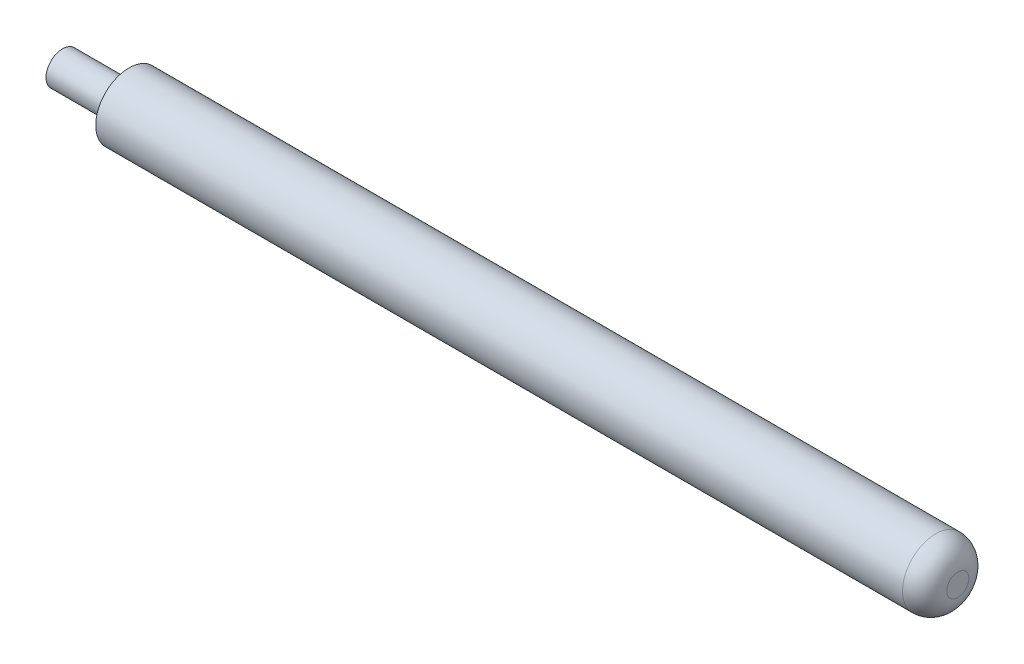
from build123d import *

# Parameters (mm, degrees)
SKETCH1_R      = 3
EXTRUDE1_DEPTH = 75
SKETCH2_R      = 1.5
EXTRUDE2_DEPTH = 6
FILLET1_R      = 2


with BuildPart() as part:
    # Sketch1 → Extrude1 (new body)
    with BuildSketch(Plane(origin=(0, 0, 0), x_dir=(0, 0, -1), z_dir=(1, 0, 0))):
        Circle(SKETCH1_R)
    extrude(amount=EXTRUDE1_DEPTH)

    # Sketch2 → Extrude2 (add)
    with BuildSketch(Plane.ZY):
        with Locations(Location((0, 0, 0), (0, 0, 180))):
            Circle(SKETCH2_R)
    extrude(amount=EXTRUDE2_DEPTH)

    # Fillet1
    fillet1_edges = [part.edges().sort_by_distance(p)[0] for p in [
        (75, 0, 3),
    ]]
    fillet(fillet1_edges, radius=FILLET1_R)


solid = part.part
